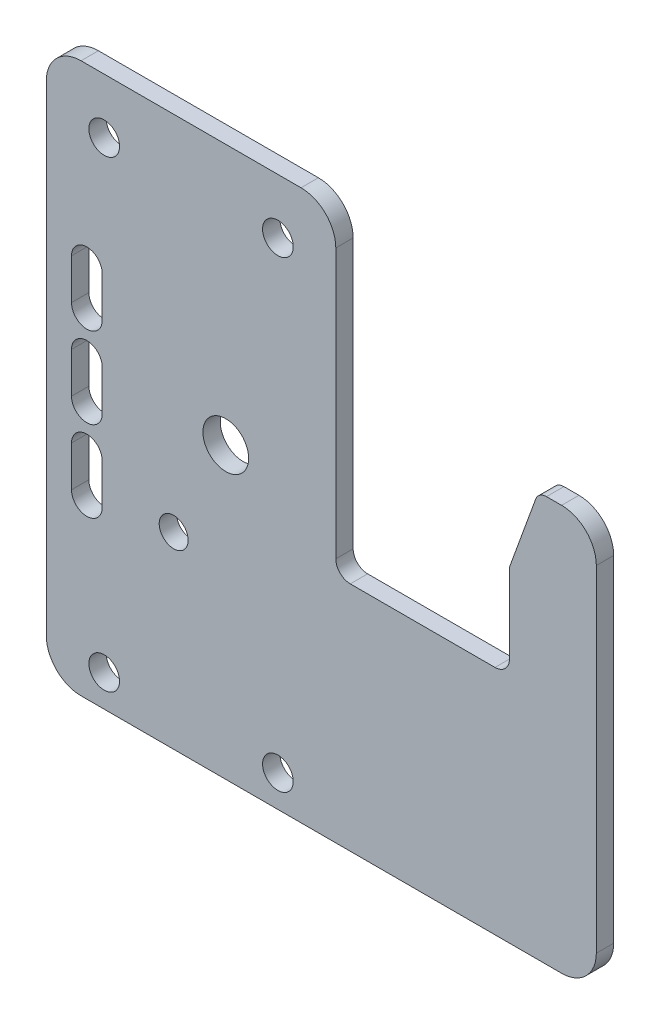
ISO-10303-21;
HEADER;
FILE_DESCRIPTION(('STEP AP214'),'2;1');
FILE_NAME('part.step','',(''),(''),'','','');
FILE_SCHEMA(('AUTOMOTIVE_DESIGN { 1 0 10303 214 1 1 1 1 }'));
ENDSEC;
DATA;
#1=APPLICATION_CONTEXT('core data for automotive mechanical design processes');
#2=APPLICATION_PROTOCOL_DEFINITION('international standard','automotive_design',2000,#1);
#3=PRODUCT_CONTEXT('',#1,'mechanical');
#4=PRODUCT('Part','Part','',(#3));
#5=PRODUCT_RELATED_PRODUCT_CATEGORY('part','',(#4));
#6=PRODUCT_DEFINITION_FORMATION('','',#4);
#7=PRODUCT_DEFINITION_CONTEXT('part definition',#1,'design');
#8=PRODUCT_DEFINITION('design','',#6,#7);
#9=PRODUCT_DEFINITION_SHAPE('','',#8);
#10=(LENGTH_UNIT() NAMED_UNIT(*) SI_UNIT(.MILLI.,.METRE.));
#11=(NAMED_UNIT(*) PLANE_ANGLE_UNIT() SI_UNIT($,.RADIAN.));
#12=(NAMED_UNIT(*) SI_UNIT($,.STERADIAN.) SOLID_ANGLE_UNIT());
#13=UNCERTAINTY_MEASURE_WITH_UNIT(LENGTH_MEASURE(1.E-05),#10,'distance_accuracy_value','');
#14=(GEOMETRIC_REPRESENTATION_CONTEXT(3) GLOBAL_UNCERTAINTY_ASSIGNED_CONTEXT((#13)) GLOBAL_UNIT_ASSIGNED_CONTEXT((#10,
#11,#12)) REPRESENTATION_CONTEXT('',''));
#15=CARTESIAN_POINT('',(0.,0.,0.));
#16=DIRECTION('',(0.,0.,1.));
#17=DIRECTION('',(1.,0.,0.));
#18=AXIS2_PLACEMENT_3D('',#15,#16,#17);
#19=CARTESIAN_POINT('',(80.,40.,3.));
#20=DIRECTION('',(1.,0.,0.));
#21=DIRECTION('',(0.,-1.,0.));
#22=AXIS2_PLACEMENT_3D('',#19,#20,#21);
#23=PLANE('',#22);
#24=DIRECTION('',(0.,0.,1.));
#25=VECTOR('',#24,1.);
#26=CARTESIAN_POINT('',(80.,55.9099589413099,3.));
#27=LINE('',#26,#25);
#28=CARTESIAN_POINT('',(80.,55.9099589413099,0.));
#29=VERTEX_POINT('',#28);
#30=CARTESIAN_POINT('',(80.,55.9099589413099,3.));
#31=VERTEX_POINT('',#30);
#32=EDGE_CURVE('E11',#29,#31,#27,.T.);
#33=ORIENTED_EDGE('',*,*,#32,.F.);
#34=DIRECTION('',(0.,1.,0.));
#35=VECTOR('',#34,1.);
#36=CARTESIAN_POINT('',(80.,0.,0.));
#37=LINE('',#36,#35);
#38=CARTESIAN_POINT('',(80.,42.5,0.));
#39=VERTEX_POINT('',#38);
#40=EDGE_CURVE('E170',#29,#39,#37,.F.);
#41=ORIENTED_EDGE('',*,*,#40,.T.);
#42=DIRECTION('',(0.,0.,1.));
#43=VECTOR('',#42,1.);
#44=CARTESIAN_POINT('',(80.,42.5,3.));
#45=LINE('',#44,#43);
#46=CARTESIAN_POINT('',(80.,42.5,3.));
#47=VERTEX_POINT('',#46);
#48=EDGE_CURVE('E44',#39,#47,#45,.T.);
#49=ORIENTED_EDGE('',*,*,#48,.T.);
#50=DIRECTION('',(0.,-1.,0.));
#51=VECTOR('',#50,1.);
#52=CARTESIAN_POINT('',(80.,40.,3.));
#53=LINE('',#52,#51);
#54=EDGE_CURVE('E311',#31,#47,#53,.T.);
#55=ORIENTED_EDGE('',*,*,#54,.F.);
#56=EDGE_LOOP('',(#33,#41,#49,#55));
#57=FACE_BOUND('',#56,.T.);
#58=ADVANCED_FACE('F34',(#57),#23,.F.);
#59=CARTESIAN_POINT('',(77.5,42.5,3.));
#60=DIRECTION('',(0.,0.,-1.));
#61=DIRECTION('',(-1.,0.,0.));
#62=AXIS2_PLACEMENT_3D('',#59,#60,#61);
#63=CYLINDRICAL_SURFACE('',#62,2.5);
#64=ORIENTED_EDGE('',*,*,#48,.F.);
#65=CARTESIAN_POINT('',(77.5,42.5,0.));
#66=DIRECTION('',(0.,0.,-1.));
#67=DIRECTION('',(-1.,0.,0.));
#68=AXIS2_PLACEMENT_3D('',#65,#66,#67);
#69=CIRCLE('',#68,2.5);
#70=CARTESIAN_POINT('',(77.5,40.,0.));
#71=VERTEX_POINT('',#70);
#72=EDGE_CURVE('E222',#39,#71,#69,.T.);
#73=ORIENTED_EDGE('',*,*,#72,.T.);
#74=DIRECTION('',(0.,0.,1.));
#75=VECTOR('',#74,1.);
#76=CARTESIAN_POINT('',(77.5,40.,3.));
#77=LINE('',#76,#75);
#78=CARTESIAN_POINT('',(77.5,40.,3.));
#79=VERTEX_POINT('',#78);
#80=EDGE_CURVE('E304',#71,#79,#77,.T.);
#81=ORIENTED_EDGE('',*,*,#80,.T.);
#82=CARTESIAN_POINT('',(77.5,42.5,3.));
#83=DIRECTION('',(0.,0.,-1.));
#84=DIRECTION('',(-1.,0.,0.));
#85=AXIS2_PLACEMENT_3D('',#82,#83,#84);
#86=CIRCLE('',#85,2.5);
#87=EDGE_CURVE('E321',#47,#79,#86,.T.);
#88=ORIENTED_EDGE('',*,*,#87,.F.);
#89=EDGE_LOOP('',(#64,#73,#81,#88));
#90=FACE_BOUND('',#89,.T.);
#91=ADVANCED_FACE('F324',(#90),#63,.F.);
#92=CARTESIAN_POINT('',(50.,40.,3.));
#93=DIRECTION('',(0.,-1.,0.));
#94=DIRECTION('',(-1.,0.,0.));
#95=AXIS2_PLACEMENT_3D('',#92,#93,#94);
#96=PLANE('',#95);
#97=ORIENTED_EDGE('',*,*,#80,.F.);
#98=DIRECTION('',(-1.,0.,0.));
#99=VECTOR('',#98,1.);
#100=CARTESIAN_POINT('',(0.,40.,0.));
#101=LINE('',#100,#99);
#102=CARTESIAN_POINT('',(52.5,40.,0.));
#103=VERTEX_POINT('',#102);
#104=EDGE_CURVE('E219',#71,#103,#101,.T.);
#105=ORIENTED_EDGE('',*,*,#104,.T.);
#106=DIRECTION('',(0.,0.,1.));
#107=VECTOR('',#106,1.);
#108=CARTESIAN_POINT('',(52.5,40.,3.));
#109=LINE('',#108,#107);
#110=CARTESIAN_POINT('',(52.5,40.,3.));
#111=VERTEX_POINT('',#110);
#112=EDGE_CURVE('E301',#103,#111,#109,.T.);
#113=ORIENTED_EDGE('',*,*,#112,.T.);
#114=DIRECTION('',(-1.,0.,0.));
#115=VECTOR('',#114,1.);
#116=CARTESIAN_POINT('',(50.,40.,3.));
#117=LINE('',#116,#115);
#118=EDGE_CURVE('E325',#79,#111,#117,.T.);
#119=ORIENTED_EDGE('',*,*,#118,.F.);
#120=EDGE_LOOP('',(#97,#105,#113,#119));
#121=FACE_BOUND('',#120,.T.);
#122=ADVANCED_FACE('F441',(#121),#96,.F.);
#123=CARTESIAN_POINT('',(52.5,42.5,3.));
#124=DIRECTION('',(0.,0.,-1.));
#125=DIRECTION('',(-1.,0.,0.));
#126=AXIS2_PLACEMENT_3D('',#123,#124,#125);
#127=CYLINDRICAL_SURFACE('',#126,2.5);
#128=ORIENTED_EDGE('',*,*,#112,.F.);
#129=CARTESIAN_POINT('',(52.5,42.5,0.));
#130=DIRECTION('',(0.,0.,-1.));
#131=DIRECTION('',(-1.,0.,0.));
#132=AXIS2_PLACEMENT_3D('',#129,#130,#131);
#133=CIRCLE('',#132,2.5);
#134=CARTESIAN_POINT('',(50.,42.5,0.));
#135=VERTEX_POINT('',#134);
#136=EDGE_CURVE('E216',#103,#135,#133,.T.);
#137=ORIENTED_EDGE('',*,*,#136,.T.);
#138=DIRECTION('',(0.,0.,1.));
#139=VECTOR('',#138,1.);
#140=CARTESIAN_POINT('',(50.,42.5,3.));
#141=LINE('',#140,#139);
#142=CARTESIAN_POINT('',(50.,42.5,3.));
#143=VERTEX_POINT('',#142);
#144=EDGE_CURVE('E298',#135,#143,#141,.T.);
#145=ORIENTED_EDGE('',*,*,#144,.T.);
#146=CARTESIAN_POINT('',(52.5,42.5,3.));
#147=DIRECTION('',(0.,0.,-1.));
#148=DIRECTION('',(-1.,0.,0.));
#149=AXIS2_PLACEMENT_3D('',#146,#147,#148);
#150=CIRCLE('',#149,2.5);
#151=EDGE_CURVE('E327',#111,#143,#150,.T.);
#152=ORIENTED_EDGE('',*,*,#151,.F.);
#153=EDGE_LOOP('',(#128,#137,#145,#152));
#154=FACE_BOUND('',#153,.T.);
#155=ADVANCED_FACE('F623',(#154),#127,.F.);
#156=CARTESIAN_POINT('',(50.,95.,3.));
#157=DIRECTION('',(-1.,0.,0.));
#158=DIRECTION('',(0.,1.,0.));
#159=AXIS2_PLACEMENT_3D('',#156,#157,#158);
#160=PLANE('',#159);
#161=ORIENTED_EDGE('',*,*,#144,.F.);
#162=DIRECTION('',(0.,1.,0.));
#163=VECTOR('',#162,1.);
#164=CARTESIAN_POINT('',(50.,0.,0.));
#165=LINE('',#164,#163);
#166=CARTESIAN_POINT('',(50.,89.,0.));
#167=VERTEX_POINT('',#166);
#168=EDGE_CURVE('E213',#135,#167,#165,.T.);
#169=ORIENTED_EDGE('',*,*,#168,.T.);
#170=DIRECTION('',(0.,0.,1.));
#171=VECTOR('',#170,1.);
#172=CARTESIAN_POINT('',(50.,89.,3.));
#173=LINE('',#172,#171);
#174=CARTESIAN_POINT('',(50.,89.,3.));
#175=VERTEX_POINT('',#174);
#176=EDGE_CURVE('E295',#167,#175,#173,.T.);
#177=ORIENTED_EDGE('',*,*,#176,.T.);
#178=DIRECTION('',(0.,1.,0.));
#179=VECTOR('',#178,1.);
#180=CARTESIAN_POINT('',(50.,95.,3.));
#181=LINE('',#180,#179);
#182=EDGE_CURVE('E333',#143,#175,#181,.T.);
#183=ORIENTED_EDGE('',*,*,#182,.F.);
#184=EDGE_LOOP('',(#161,#169,#177,#183));
#185=FACE_BOUND('',#184,.T.);
#186=ADVANCED_FACE('F618',(#185),#160,.F.);
#187=CARTESIAN_POINT('',(44.,89.,3.));
#188=DIRECTION('',(0.,0.,-1.));
#189=DIRECTION('',(-1.,0.,0.));
#190=AXIS2_PLACEMENT_3D('',#187,#188,#189);
#191=CYLINDRICAL_SURFACE('',#190,6.);
#192=ORIENTED_EDGE('',*,*,#176,.F.);
#193=CARTESIAN_POINT('',(44.,89.,0.));
#194=DIRECTION('',(0.,0.,-1.));
#195=DIRECTION('',(-1.,0.,0.));
#196=AXIS2_PLACEMENT_3D('',#193,#194,#195);
#197=CIRCLE('',#196,6.);
#198=CARTESIAN_POINT('',(44.,95.,0.));
#199=VERTEX_POINT('',#198);
#200=EDGE_CURVE('E210',#167,#199,#197,.F.);
#201=ORIENTED_EDGE('',*,*,#200,.T.);
#202=DIRECTION('',(0.,0.,1.));
#203=VECTOR('',#202,1.);
#204=CARTESIAN_POINT('',(44.,95.,3.));
#205=LINE('',#204,#203);
#206=CARTESIAN_POINT('',(44.,95.,3.));
#207=VERTEX_POINT('',#206);
#208=EDGE_CURVE('E292',#199,#207,#205,.T.);
#209=ORIENTED_EDGE('',*,*,#208,.T.);
#210=CARTESIAN_POINT('',(44.,89.,3.));
#211=DIRECTION('',(0.,0.,-1.));
#212=DIRECTION('',(-1.,0.,0.));
#213=AXIS2_PLACEMENT_3D('',#210,#211,#212);
#214=CIRCLE('',#213,6.);
#215=EDGE_CURVE('E336',#175,#207,#214,.F.);
#216=ORIENTED_EDGE('',*,*,#215,.F.);
#217=EDGE_LOOP('',(#192,#201,#209,#216));
#218=FACE_BOUND('',#217,.T.);
#219=ADVANCED_FACE('F614',(#218),#191,.T.);
#220=CARTESIAN_POINT('',(0.,95.,3.));
#221=DIRECTION('',(0.,-1.,0.));
#222=DIRECTION('',(-1.,0.,0.));
#223=AXIS2_PLACEMENT_3D('',#220,#221,#222);
#224=PLANE('',#223);
#225=ORIENTED_EDGE('',*,*,#208,.F.);
#226=DIRECTION('',(-1.,0.,0.));
#227=VECTOR('',#226,1.);
#228=CARTESIAN_POINT('',(0.,95.,0.));
#229=LINE('',#228,#227);
#230=CARTESIAN_POINT('',(6.,95.,0.));
#231=VERTEX_POINT('',#230);
#232=EDGE_CURVE('E207',#199,#231,#229,.T.);
#233=ORIENTED_EDGE('',*,*,#232,.T.);
#234=DIRECTION('',(0.,0.,1.));
#235=VECTOR('',#234,1.);
#236=CARTESIAN_POINT('',(6.,95.,3.));
#237=LINE('',#236,#235);
#238=CARTESIAN_POINT('',(6.,95.,3.));
#239=VERTEX_POINT('',#238);
#240=EDGE_CURVE('E289',#231,#239,#237,.T.);
#241=ORIENTED_EDGE('',*,*,#240,.T.);
#242=DIRECTION('',(-1.,0.,0.));
#243=VECTOR('',#242,1.);
#244=CARTESIAN_POINT('',(0.,95.,3.));
#245=LINE('',#244,#243);
#246=EDGE_CURVE('E339',#207,#239,#245,.T.);
#247=ORIENTED_EDGE('',*,*,#246,.F.);
#248=EDGE_LOOP('',(#225,#233,#241,#247));
#249=FACE_BOUND('',#248,.T.);
#250=ADVANCED_FACE('F611',(#249),#224,.F.);
#251=CARTESIAN_POINT('',(6.,89.,3.));
#252=DIRECTION('',(0.,0.,-1.));
#253=DIRECTION('',(-1.,0.,0.));
#254=AXIS2_PLACEMENT_3D('',#251,#252,#253);
#255=CYLINDRICAL_SURFACE('',#254,6.);
#256=ORIENTED_EDGE('',*,*,#240,.F.);
#257=CARTESIAN_POINT('',(6.,89.,0.));
#258=DIRECTION('',(0.,0.,-1.));
#259=DIRECTION('',(-1.,0.,0.));
#260=AXIS2_PLACEMENT_3D('',#257,#258,#259);
#261=CIRCLE('',#260,6.);
#262=CARTESIAN_POINT('',(0.,89.,0.));
#263=VERTEX_POINT('',#262);
#264=EDGE_CURVE('E204',#231,#263,#261,.F.);
#265=ORIENTED_EDGE('',*,*,#264,.T.);
#266=DIRECTION('',(0.,0.,1.));
#267=VECTOR('',#266,1.);
#268=CARTESIAN_POINT('',(0.,89.,3.));
#269=LINE('',#268,#267);
#270=CARTESIAN_POINT('',(0.,89.,3.));
#271=VERTEX_POINT('',#270);
#272=EDGE_CURVE('E286',#263,#271,#269,.T.);
#273=ORIENTED_EDGE('',*,*,#272,.T.);
#274=CARTESIAN_POINT('',(6.,89.,3.));
#275=DIRECTION('',(0.,0.,-1.));
#276=DIRECTION('',(-1.,0.,0.));
#277=AXIS2_PLACEMENT_3D('',#274,#275,#276);
#278=CIRCLE('',#277,6.);
#279=EDGE_CURVE('E342',#239,#271,#278,.F.);
#280=ORIENTED_EDGE('',*,*,#279,.F.);
#281=EDGE_LOOP('',(#256,#265,#273,#280));
#282=FACE_BOUND('',#281,.T.);
#283=ADVANCED_FACE('F606',(#282),#255,.T.);
#284=CARTESIAN_POINT('',(0.,0.,3.));
#285=DIRECTION('',(1.,0.,0.));
#286=DIRECTION('',(0.,-1.,0.));
#287=AXIS2_PLACEMENT_3D('',#284,#285,#286);
#288=PLANE('',#287);
#289=ORIENTED_EDGE('',*,*,#272,.F.);
#290=DIRECTION('',(0.,1.,0.));
#291=VECTOR('',#290,1.);
#292=CARTESIAN_POINT('',(0.,0.,0.));
#293=LINE('',#292,#291);
#294=CARTESIAN_POINT('',(0.,6.,0.));
#295=VERTEX_POINT('',#294);
#296=EDGE_CURVE('E201',#263,#295,#293,.F.);
#297=ORIENTED_EDGE('',*,*,#296,.T.);
#298=DIRECTION('',(0.,0.,1.));
#299=VECTOR('',#298,1.);
#300=CARTESIAN_POINT('',(0.,6.,3.));
#301=LINE('',#300,#299);
#302=CARTESIAN_POINT('',(0.,6.,3.));
#303=VERTEX_POINT('',#302);
#304=EDGE_CURVE('E283',#295,#303,#301,.T.);
#305=ORIENTED_EDGE('',*,*,#304,.T.);
#306=DIRECTION('',(0.,-1.,0.));
#307=VECTOR('',#306,1.);
#308=CARTESIAN_POINT('',(0.,0.,3.));
#309=LINE('',#308,#307);
#310=EDGE_CURVE('E345',#271,#303,#309,.T.);
#311=ORIENTED_EDGE('',*,*,#310,.F.);
#312=EDGE_LOOP('',(#289,#297,#305,#311));
#313=FACE_BOUND('',#312,.T.);
#314=ADVANCED_FACE('F602',(#313),#288,.F.);
#315=CARTESIAN_POINT('',(6.00000000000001,6.,3.));
#316=DIRECTION('',(0.,0.,-1.));
#317=DIRECTION('',(-1.,0.,0.));
#318=AXIS2_PLACEMENT_3D('',#315,#316,#317);
#319=CYLINDRICAL_SURFACE('',#318,6.);
#320=ORIENTED_EDGE('',*,*,#304,.F.);
#321=CARTESIAN_POINT('',(6.00000000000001,6.,0.));
#322=DIRECTION('',(0.,0.,-1.));
#323=DIRECTION('',(-1.,0.,0.));
#324=AXIS2_PLACEMENT_3D('',#321,#322,#323);
#325=CIRCLE('',#324,6.);
#326=CARTESIAN_POINT('',(6.00000000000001,0.,0.));
#327=VERTEX_POINT('',#326);
#328=EDGE_CURVE('E198',#295,#327,#325,.F.);
#329=ORIENTED_EDGE('',*,*,#328,.T.);
#330=DIRECTION('',(0.,0.,1.));
#331=VECTOR('',#330,1.);
#332=CARTESIAN_POINT('',(6.00000000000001,0.,3.));
#333=LINE('',#332,#331);
#334=CARTESIAN_POINT('',(6.00000000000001,0.,3.));
#335=VERTEX_POINT('',#334);
#336=EDGE_CURVE('E280',#327,#335,#333,.T.);
#337=ORIENTED_EDGE('',*,*,#336,.T.);
#338=CARTESIAN_POINT('',(6.00000000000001,6.,3.));
#339=DIRECTION('',(0.,0.,-1.));
#340=DIRECTION('',(-1.,0.,0.));
#341=AXIS2_PLACEMENT_3D('',#338,#339,#340);
#342=CIRCLE('',#341,6.);
#343=EDGE_CURVE('E348',#303,#335,#342,.F.);
#344=ORIENTED_EDGE('',*,*,#343,.F.);
#345=EDGE_LOOP('',(#320,#329,#337,#344));
#346=FACE_BOUND('',#345,.T.);
#347=ADVANCED_FACE('F599',(#346),#319,.T.);
#348=CARTESIAN_POINT('',(95.,0.,3.));
#349=DIRECTION('',(0.,1.,0.));
#350=DIRECTION('',(1.,0.,0.));
#351=AXIS2_PLACEMENT_3D('',#348,#349,#350);
#352=PLANE('',#351);
#353=ORIENTED_EDGE('',*,*,#336,.F.);
#354=DIRECTION('',(-1.,0.,0.));
#355=VECTOR('',#354,1.);
#356=CARTESIAN_POINT('',(0.,0.,0.));
#357=LINE('',#356,#355);
#358=CARTESIAN_POINT('',(89.,0.,0.));
#359=VERTEX_POINT('',#358);
#360=EDGE_CURVE('E195',#327,#359,#357,.F.);
#361=ORIENTED_EDGE('',*,*,#360,.T.);
#362=DIRECTION('',(0.,0.,1.));
#363=VECTOR('',#362,1.);
#364=CARTESIAN_POINT('',(89.,0.,3.));
#365=LINE('',#364,#363);
#366=CARTESIAN_POINT('',(89.,0.,3.));
#367=VERTEX_POINT('',#366);
#368=EDGE_CURVE('E277',#359,#367,#365,.T.);
#369=ORIENTED_EDGE('',*,*,#368,.T.);
#370=DIRECTION('',(1.,0.,0.));
#371=VECTOR('',#370,1.);
#372=CARTESIAN_POINT('',(95.,0.,3.));
#373=LINE('',#372,#371);
#374=EDGE_CURVE('E351',#335,#367,#373,.T.);
#375=ORIENTED_EDGE('',*,*,#374,.F.);
#376=EDGE_LOOP('',(#353,#361,#369,#375));
#377=FACE_BOUND('',#376,.T.);
#378=ADVANCED_FACE('F594',(#377),#352,.F.);
#379=CARTESIAN_POINT('',(89.,6.00000000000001,3.));
#380=DIRECTION('',(0.,0.,-1.));
#381=DIRECTION('',(-1.,0.,0.));
#382=AXIS2_PLACEMENT_3D('',#379,#380,#381);
#383=CYLINDRICAL_SURFACE('',#382,6.);
#384=ORIENTED_EDGE('',*,*,#368,.F.);
#385=CARTESIAN_POINT('',(89.,6.00000000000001,0.));
#386=DIRECTION('',(0.,0.,-1.));
#387=DIRECTION('',(-1.,0.,0.));
#388=AXIS2_PLACEMENT_3D('',#385,#386,#387);
#389=CIRCLE('',#388,6.);
#390=CARTESIAN_POINT('',(95.,6.00000000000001,0.));
#391=VERTEX_POINT('',#390);
#392=EDGE_CURVE('E192',#359,#391,#389,.F.);
#393=ORIENTED_EDGE('',*,*,#392,.T.);
#394=DIRECTION('',(0.,0.,1.));
#395=VECTOR('',#394,1.);
#396=CARTESIAN_POINT('',(95.,6.00000000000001,3.));
#397=LINE('',#396,#395);
#398=CARTESIAN_POINT('',(95.,6.00000000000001,3.));
#399=VERTEX_POINT('',#398);
#400=EDGE_CURVE('E274',#391,#399,#397,.T.);
#401=ORIENTED_EDGE('',*,*,#400,.T.);
#402=CARTESIAN_POINT('',(89.,6.00000000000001,3.));
#403=DIRECTION('',(0.,0.,-1.));
#404=DIRECTION('',(-1.,0.,0.));
#405=AXIS2_PLACEMENT_3D('',#402,#403,#404);
#406=CIRCLE('',#405,6.);
#407=EDGE_CURVE('E354',#367,#399,#406,.F.);
#408=ORIENTED_EDGE('',*,*,#407,.F.);
#409=EDGE_LOOP('',(#384,#393,#401,#408));
#410=FACE_BOUND('',#409,.T.);
#411=ADVANCED_FACE('F590',(#410),#383,.T.);
#412=CARTESIAN_POINT('',(95.,70.,3.));
#413=DIRECTION('',(-1.,0.,0.));
#414=DIRECTION('',(0.,1.,0.));
#415=AXIS2_PLACEMENT_3D('',#412,#413,#414);
#416=PLANE('',#415);
#417=ORIENTED_EDGE('',*,*,#400,.F.);
#418=DIRECTION('',(0.,1.,0.));
#419=VECTOR('',#418,1.);
#420=CARTESIAN_POINT('',(95.,0.,0.));
#421=LINE('',#420,#419);
#422=CARTESIAN_POINT('',(95.,64.,0.));
#423=VERTEX_POINT('',#422);
#424=EDGE_CURVE('E189',#391,#423,#421,.T.);
#425=ORIENTED_EDGE('',*,*,#424,.T.);
#426=DIRECTION('',(0.,0.,1.));
#427=VECTOR('',#426,1.);
#428=CARTESIAN_POINT('',(95.,64.,3.));
#429=LINE('',#428,#427);
#430=CARTESIAN_POINT('',(95.,64.,3.));
#431=VERTEX_POINT('',#430);
#432=EDGE_CURVE('E271',#423,#431,#429,.T.);
#433=ORIENTED_EDGE('',*,*,#432,.T.);
#434=DIRECTION('',(0.,1.,0.));
#435=VECTOR('',#434,1.);
#436=CARTESIAN_POINT('',(95.,70.,3.));
#437=LINE('',#436,#435);
#438=EDGE_CURVE('E357',#399,#431,#437,.T.);
#439=ORIENTED_EDGE('',*,*,#438,.F.);
#440=EDGE_LOOP('',(#417,#425,#433,#439));
#441=FACE_BOUND('',#440,.T.);
#442=ADVANCED_FACE('F587',(#441),#416,.F.);
#443=CARTESIAN_POINT('',(89.,64.,3.));
#444=DIRECTION('',(0.,0.,-1.));
#445=DIRECTION('',(-1.,0.,0.));
#446=AXIS2_PLACEMENT_3D('',#443,#444,#445);
#447=CYLINDRICAL_SURFACE('',#446,6.);
#448=ORIENTED_EDGE('',*,*,#432,.F.);
#449=CARTESIAN_POINT('',(89.,64.,0.));
#450=DIRECTION('',(0.,0.,-1.));
#451=DIRECTION('',(-1.,0.,0.));
#452=AXIS2_PLACEMENT_3D('',#449,#450,#451);
#453=CIRCLE('',#452,6.);
#454=CARTESIAN_POINT('',(89.,70.,0.));
#455=VERTEX_POINT('',#454);
#456=EDGE_CURVE('E186',#423,#455,#453,.F.);
#457=ORIENTED_EDGE('',*,*,#456,.T.);
#458=DIRECTION('',(0.,0.,1.));
#459=VECTOR('',#458,1.);
#460=CARTESIAN_POINT('',(89.,70.,3.));
#461=LINE('',#460,#459);
#462=CARTESIAN_POINT('',(89.,70.,3.));
#463=VERTEX_POINT('',#462);
#464=EDGE_CURVE('E268',#455,#463,#461,.T.);
#465=ORIENTED_EDGE('',*,*,#464,.T.);
#466=CARTESIAN_POINT('',(89.,64.,3.));
#467=DIRECTION('',(0.,0.,-1.));
#468=DIRECTION('',(-1.,0.,0.));
#469=AXIS2_PLACEMENT_3D('',#466,#467,#468);
#470=CIRCLE('',#469,6.);
#471=EDGE_CURVE('E360',#431,#463,#470,.F.);
#472=ORIENTED_EDGE('',*,*,#471,.F.);
#473=EDGE_LOOP('',(#448,#457,#465,#472));
#474=FACE_BOUND('',#473,.T.);
#475=ADVANCED_FACE('F576',(#474),#447,.T.);
#476=CARTESIAN_POINT('',(80.,70.,3.));
#477=DIRECTION('',(0.,-1.,0.));
#478=DIRECTION('',(-1.,0.,0.));
#479=AXIS2_PLACEMENT_3D('',#476,#477,#478);
#480=PLANE('',#479);
#481=ORIENTED_EDGE('',*,*,#464,.F.);
#482=DIRECTION('',(-1.,0.,0.));
#483=VECTOR('',#482,1.);
#484=CARTESIAN_POINT('',(0.,70.,0.));
#485=LINE('',#484,#483);
#486=CARTESIAN_POINT('',(86.4004150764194,70.,0.));
#487=VERTEX_POINT('',#486);
#488=EDGE_CURVE('E183',#455,#487,#485,.T.);
#489=ORIENTED_EDGE('',*,*,#488,.T.);
#490=DIRECTION('',(0.,0.,1.));
#491=VECTOR('',#490,1.);
#492=CARTESIAN_POINT('',(86.4004150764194,70.,3.));
#493=LINE('',#492,#491);
#494=CARTESIAN_POINT('',(86.4004150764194,70.,3.));
#495=VERTEX_POINT('',#494);
#496=EDGE_CURVE('E266',#487,#495,#493,.T.);
#497=ORIENTED_EDGE('',*,*,#496,.T.);
#498=DIRECTION('',(-1.,0.,0.));
#499=VECTOR('',#498,1.);
#500=CARTESIAN_POINT('',(80.,70.,3.));
#501=LINE('',#500,#499);
#502=EDGE_CURVE('E363',#463,#495,#501,.T.);
#503=ORIENTED_EDGE('',*,*,#502,.F.);
#504=EDGE_LOOP('',(#481,#489,#497,#503));
#505=FACE_BOUND('',#504,.T.);
#506=ADVANCED_FACE('F582',(#505),#480,.F.);
#507=CARTESIAN_POINT('',(86.4004150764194,68.,3.));
#508=DIRECTION('',(0.,0.,-1.));
#509=DIRECTION('',(-1.,0.,0.));
#510=AXIS2_PLACEMENT_3D('',#507,#508,#509);
#511=CYLINDRICAL_SURFACE('',#510,2.);
#512=ORIENTED_EDGE('',*,*,#496,.F.);
#513=CARTESIAN_POINT('',(86.4004150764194,68.,0.));
#514=DIRECTION('',(0.,0.,-1.));
#515=DIRECTION('',(-1.,0.,0.));
#516=AXIS2_PLACEMENT_3D('',#513,#514,#515);
#517=CIRCLE('',#516,2.);
#518=CARTESIAN_POINT('',(84.5210298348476,68.6840402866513,0.));
#519=VERTEX_POINT('',#518);
#520=EDGE_CURVE('E180',#487,#519,#517,.F.);
#521=ORIENTED_EDGE('',*,*,#520,.T.);
#522=DIRECTION('',(0.,0.,1.));
#523=VECTOR('',#522,1.);
#524=CARTESIAN_POINT('',(84.5210298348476,68.6840402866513,3.));
#525=LINE('',#524,#523);
#526=CARTESIAN_POINT('',(84.5210298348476,68.6840402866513,3.));
#527=VERTEX_POINT('',#526);
#528=EDGE_CURVE('E52',#519,#527,#525,.T.);
#529=ORIENTED_EDGE('',*,*,#528,.T.);
#530=CARTESIAN_POINT('',(86.4004150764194,68.,3.));
#531=DIRECTION('',(0.,0.,-1.));
#532=DIRECTION('',(-1.,0.,0.));
#533=AXIS2_PLACEMENT_3D('',#530,#531,#532);
#534=CIRCLE('',#533,2.);
#535=EDGE_CURVE('E366',#495,#527,#534,.F.);
#536=ORIENTED_EDGE('',*,*,#535,.F.);
#537=EDGE_LOOP('',(#512,#521,#529,#536));
#538=FACE_BOUND('',#537,.T.);
#539=ADVANCED_FACE('F583',(#538),#511,.T.);
#540=CARTESIAN_POINT('',(80.,56.2626129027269,3.));
#541=DIRECTION('',(-0.939692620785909,0.342020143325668,0.));
#542=DIRECTION('',(0.342020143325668,0.939692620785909,0.));
#543=AXIS2_PLACEMENT_3D('',#540,#541,#542);
#544=PLANE('',#543);
#545=ORIENTED_EDGE('',*,*,#528,.F.);
#546=DIRECTION('',(0.342020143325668,0.939692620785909,0.));
#547=VECTOR('',#546,1.);
#548=CARTESIAN_POINT('',(80.,56.2626129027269,0.));
#549=LINE('',#548,#547);
#550=CARTESIAN_POINT('',(80.1206147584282,56.5939992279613,0.));
#551=VERTEX_POINT('',#550);
#552=EDGE_CURVE('E168',#519,#551,#549,.F.);
#553=ORIENTED_EDGE('',*,*,#552,.T.);
#554=DIRECTION('',(0.,0.,1.));
#555=VECTOR('',#554,1.);
#556=CARTESIAN_POINT('',(80.1206147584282,56.5939992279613,3.));
#557=LINE('',#556,#555);
#558=CARTESIAN_POINT('',(80.1206147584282,56.5939992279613,3.));
#559=VERTEX_POINT('',#558);
#560=EDGE_CURVE('E38',#551,#559,#557,.T.);
#561=ORIENTED_EDGE('',*,*,#560,.T.);
#562=DIRECTION('',(0.342020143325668,0.939692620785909,0.));
#563=VECTOR('',#562,1.);
#564=CARTESIAN_POINT('',(80.,56.2626129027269,3.));
#565=LINE('',#564,#563);
#566=EDGE_CURVE('E544',#527,#559,#565,.F.);
#567=ORIENTED_EDGE('',*,*,#566,.F.);
#568=EDGE_LOOP('',(#545,#553,#561,#567));
#569=FACE_BOUND('',#568,.T.);
#570=ADVANCED_FACE('F172',(#569),#544,.T.);
#571=CARTESIAN_POINT('',(9.65,65.,3.));
#572=DIRECTION('',(-1.,0.,0.));
#573=DIRECTION('',(0.,1.,0.));
#574=AXIS2_PLACEMENT_3D('',#571,#572,#573);
#575=PLANE('',#574);
#576=DIRECTION('',(0.,0.,1.));
#577=VECTOR('',#576,1.);
#578=CARTESIAN_POINT('',(9.65,65.,3.));
#579=LINE('',#578,#577);
#580=CARTESIAN_POINT('',(9.65,65.,0.));
#581=VERTEX_POINT('',#580);
#582=CARTESIAN_POINT('',(9.65,65.,3.));
#583=VERTEX_POINT('',#582);
#584=EDGE_CURVE('E162',#581,#583,#579,.T.);
#585=ORIENTED_EDGE('',*,*,#584,.F.);
#586=DIRECTION('',(0.,1.,0.));
#587=VECTOR('',#586,1.);
#588=CARTESIAN_POINT('',(9.65,0.,0.));
#589=LINE('',#588,#587);
#590=CARTESIAN_POINT('',(9.65,58.,0.));
#591=VERTEX_POINT('',#590);
#592=EDGE_CURVE('E403',#591,#581,#589,.T.);
#593=ORIENTED_EDGE('',*,*,#592,.F.);
#594=DIRECTION('',(0.,0.,1.));
#595=VECTOR('',#594,1.);
#596=CARTESIAN_POINT('',(9.65,58.,3.));
#597=LINE('',#596,#595);
#598=CARTESIAN_POINT('',(9.65,58.,3.));
#599=VERTEX_POINT('',#598);
#600=EDGE_CURVE('E258',#591,#599,#597,.T.);
#601=ORIENTED_EDGE('',*,*,#600,.T.);
#602=DIRECTION('',(0.,1.,0.));
#603=VECTOR('',#602,1.);
#604=CARTESIAN_POINT('',(9.65,65.,3.));
#605=LINE('',#604,#603);
#606=EDGE_CURVE('E979',#599,#583,#605,.T.);
#607=ORIENTED_EDGE('',*,*,#606,.T.);
#608=EDGE_LOOP('',(#585,#593,#601,#607));
#609=FACE_BOUND('',#608,.T.);
#610=ADVANCED_FACE('F503',(#609),#575,.T.);
#611=CARTESIAN_POINT('',(7.,58.,3.));
#612=DIRECTION('',(0.,0.,1.));
#613=DIRECTION('',(1.,0.,0.));
#614=AXIS2_PLACEMENT_3D('',#611,#612,#613);
#615=CYLINDRICAL_SURFACE('',#614,2.65);
#616=ORIENTED_EDGE('',*,*,#600,.F.);
#617=CARTESIAN_POINT('',(7.,58.,0.));
#618=DIRECTION('',(0.,0.,1.));
#619=DIRECTION('',(1.,0.,0.));
#620=AXIS2_PLACEMENT_3D('',#617,#618,#619);
#621=CIRCLE('',#620,2.65);
#622=CARTESIAN_POINT('',(4.35,58.,0.));
#623=VERTEX_POINT('',#622);
#624=EDGE_CURVE('E399',#623,#591,#621,.T.);
#625=ORIENTED_EDGE('',*,*,#624,.F.);
#626=DIRECTION('',(0.,0.,1.));
#627=VECTOR('',#626,1.);
#628=CARTESIAN_POINT('',(4.35,58.,3.));
#629=LINE('',#628,#627);
#630=CARTESIAN_POINT('',(4.35,58.,3.));
#631=VERTEX_POINT('',#630);
#632=EDGE_CURVE('E255',#623,#631,#629,.T.);
#633=ORIENTED_EDGE('',*,*,#632,.T.);
#634=CARTESIAN_POINT('',(7.,58.,3.));
#635=DIRECTION('',(0.,0.,1.));
#636=DIRECTION('',(1.,0.,0.));
#637=AXIS2_PLACEMENT_3D('',#634,#635,#636);
#638=CIRCLE('',#637,2.65);
#639=EDGE_CURVE('E536',#631,#599,#638,.T.);
#640=ORIENTED_EDGE('',*,*,#639,.T.);
#641=EDGE_LOOP('',(#616,#625,#633,#640));
#642=FACE_BOUND('',#641,.T.);
#643=ADVANCED_FACE('F499',(#642),#615,.F.);
#644=CARTESIAN_POINT('',(4.35,65.,3.));
#645=DIRECTION('',(1.,0.,0.));
#646=DIRECTION('',(0.,-1.,0.));
#647=AXIS2_PLACEMENT_3D('',#644,#645,#646);
#648=PLANE('',#647);
#649=ORIENTED_EDGE('',*,*,#632,.F.);
#650=DIRECTION('',(0.,1.,0.));
#651=VECTOR('',#650,1.);
#652=CARTESIAN_POINT('',(4.35,0.,0.));
#653=LINE('',#652,#651);
#654=CARTESIAN_POINT('',(4.35,65.,0.));
#655=VERTEX_POINT('',#654);
#656=EDGE_CURVE('E390',#655,#623,#653,.F.);
#657=ORIENTED_EDGE('',*,*,#656,.F.);
#658=DIRECTION('',(0.,0.,1.));
#659=VECTOR('',#658,1.);
#660=CARTESIAN_POINT('',(4.35,65.,3.));
#661=LINE('',#660,#659);
#662=CARTESIAN_POINT('',(4.35,65.,3.));
#663=VERTEX_POINT('',#662);
#664=EDGE_CURVE('E252',#655,#663,#661,.T.);
#665=ORIENTED_EDGE('',*,*,#664,.T.);
#666=DIRECTION('',(0.,-1.,0.));
#667=VECTOR('',#666,1.);
#668=CARTESIAN_POINT('',(4.35,65.,3.));
#669=LINE('',#668,#667);
#670=EDGE_CURVE('E993',#663,#631,#669,.T.);
#671=ORIENTED_EDGE('',*,*,#670,.T.);
#672=EDGE_LOOP('',(#649,#657,#665,#671));
#673=FACE_BOUND('',#672,.T.);
#674=ADVANCED_FACE('F494',(#673),#648,.T.);
#675=CARTESIAN_POINT('',(9.65,51.,3.));
#676=DIRECTION('',(-1.,0.,0.));
#677=DIRECTION('',(0.,1.,0.));
#678=AXIS2_PLACEMENT_3D('',#675,#676,#677);
#679=PLANE('',#678);
#680=DIRECTION('',(0.,0.,1.));
#681=VECTOR('',#680,1.);
#682=CARTESIAN_POINT('',(9.65,51.,3.));
#683=LINE('',#682,#681);
#684=CARTESIAN_POINT('',(9.65,51.,0.));
#685=VERTEX_POINT('',#684);
#686=CARTESIAN_POINT('',(9.65,51.,3.));
#687=VERTEX_POINT('',#686);
#688=EDGE_CURVE('E249',#685,#687,#683,.T.);
#689=ORIENTED_EDGE('',*,*,#688,.F.);
#690=DIRECTION('',(0.,1.,0.));
#691=VECTOR('',#690,1.);
#692=CARTESIAN_POINT('',(9.65,0.,0.));
#693=LINE('',#692,#691);
#694=CARTESIAN_POINT('',(9.65,44.,0.));
#695=VERTEX_POINT('',#694);
#696=EDGE_CURVE('E391',#695,#685,#693,.T.);
#697=ORIENTED_EDGE('',*,*,#696,.F.);
#698=DIRECTION('',(0.,0.,1.));
#699=VECTOR('',#698,1.);
#700=CARTESIAN_POINT('',(9.65,44.,3.));
#701=LINE('',#700,#699);
#702=CARTESIAN_POINT('',(9.65,44.,3.));
#703=VERTEX_POINT('',#702);
#704=EDGE_CURVE('E246',#695,#703,#701,.T.);
#705=ORIENTED_EDGE('',*,*,#704,.T.);
#706=DIRECTION('',(0.,1.,0.));
#707=VECTOR('',#706,1.);
#708=CARTESIAN_POINT('',(9.65,51.,3.));
#709=LINE('',#708,#707);
#710=EDGE_CURVE('E998',#703,#687,#709,.T.);
#711=ORIENTED_EDGE('',*,*,#710,.T.);
#712=EDGE_LOOP('',(#689,#697,#705,#711));
#713=FACE_BOUND('',#712,.T.);
#714=ADVANCED_FACE('F491',(#713),#679,.T.);
#715=CARTESIAN_POINT('',(6.99999999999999,44.,3.));
#716=DIRECTION('',(0.,0.,1.));
#717=DIRECTION('',(1.,0.,0.));
#718=AXIS2_PLACEMENT_3D('',#715,#716,#717);
#719=CYLINDRICAL_SURFACE('',#718,2.65);
#720=ORIENTED_EDGE('',*,*,#704,.F.);
#721=CARTESIAN_POINT('',(6.99999999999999,44.,0.));
#722=DIRECTION('',(0.,0.,1.));
#723=DIRECTION('',(1.,0.,0.));
#724=AXIS2_PLACEMENT_3D('',#721,#722,#723);
#725=CIRCLE('',#724,2.65);
#726=CARTESIAN_POINT('',(4.34999999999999,44.,0.));
#727=VERTEX_POINT('',#726);
#728=EDGE_CURVE('E387',#727,#695,#725,.T.);
#729=ORIENTED_EDGE('',*,*,#728,.F.);
#730=DIRECTION('',(0.,0.,1.));
#731=VECTOR('',#730,1.);
#732=CARTESIAN_POINT('',(4.34999999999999,44.,3.));
#733=LINE('',#732,#731);
#734=CARTESIAN_POINT('',(4.34999999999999,44.,3.));
#735=VERTEX_POINT('',#734);
#736=EDGE_CURVE('E243',#727,#735,#733,.T.);
#737=ORIENTED_EDGE('',*,*,#736,.T.);
#738=CARTESIAN_POINT('',(6.99999999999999,44.,3.));
#739=DIRECTION('',(0.,0.,1.));
#740=DIRECTION('',(1.,0.,0.));
#741=AXIS2_PLACEMENT_3D('',#738,#739,#740);
#742=CIRCLE('',#741,2.65);
#743=EDGE_CURVE('E995',#735,#703,#742,.T.);
#744=ORIENTED_EDGE('',*,*,#743,.T.);
#745=EDGE_LOOP('',(#720,#729,#737,#744));
#746=FACE_BOUND('',#745,.T.);
#747=ADVANCED_FACE('F487',(#746),#719,.F.);
#748=CARTESIAN_POINT('',(4.35,51.,3.));
#749=DIRECTION('',(1.,0.,0.));
#750=DIRECTION('',(0.,-1.,0.));
#751=AXIS2_PLACEMENT_3D('',#748,#749,#750);
#752=PLANE('',#751);
#753=ORIENTED_EDGE('',*,*,#736,.F.);
#754=DIRECTION('',(0.,1.,0.));
#755=VECTOR('',#754,1.);
#756=CARTESIAN_POINT('',(4.35,0.,0.));
#757=LINE('',#756,#755);
#758=CARTESIAN_POINT('',(4.35,51.,0.));
#759=VERTEX_POINT('',#758);
#760=EDGE_CURVE('E378',#759,#727,#757,.F.);
#761=ORIENTED_EDGE('',*,*,#760,.F.);
#762=DIRECTION('',(0.,0.,1.));
#763=VECTOR('',#762,1.);
#764=CARTESIAN_POINT('',(4.35,51.,3.));
#765=LINE('',#764,#763);
#766=CARTESIAN_POINT('',(4.35,51.,3.));
#767=VERTEX_POINT('',#766);
#768=EDGE_CURVE('E239',#759,#767,#765,.T.);
#769=ORIENTED_EDGE('',*,*,#768,.T.);
#770=DIRECTION('',(0.,-1.,0.));
#771=VECTOR('',#770,1.);
#772=CARTESIAN_POINT('',(4.35,51.,3.));
#773=LINE('',#772,#771);
#774=EDGE_CURVE('E1004',#767,#735,#773,.T.);
#775=ORIENTED_EDGE('',*,*,#774,.T.);
#776=EDGE_LOOP('',(#753,#761,#769,#775));
#777=FACE_BOUND('',#776,.T.);
#778=ADVANCED_FACE('F484',(#777),#752,.T.);
#779=CARTESIAN_POINT('',(9.64999999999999,37.,3.));
#780=DIRECTION('',(-1.,0.,0.));
#781=DIRECTION('',(0.,1.,0.));
#782=AXIS2_PLACEMENT_3D('',#779,#780,#781);
#783=PLANE('',#782);
#784=DIRECTION('',(0.,0.,1.));
#785=VECTOR('',#784,1.);
#786=CARTESIAN_POINT('',(9.64999999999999,37.,3.));
#787=LINE('',#786,#785);
#788=CARTESIAN_POINT('',(9.64999999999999,37.,0.));
#789=VERTEX_POINT('',#788);
#790=CARTESIAN_POINT('',(9.64999999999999,37.,3.));
#791=VERTEX_POINT('',#790);
#792=EDGE_CURVE('E236',#789,#791,#787,.T.);
#793=ORIENTED_EDGE('',*,*,#792,.F.);
#794=DIRECTION('',(0.,1.,0.));
#795=VECTOR('',#794,1.);
#796=CARTESIAN_POINT('',(9.64999999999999,0.,0.));
#797=LINE('',#796,#795);
#798=CARTESIAN_POINT('',(9.64999999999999,30.,0.));
#799=VERTEX_POINT('',#798);
#800=EDGE_CURVE('E379',#799,#789,#797,.T.);
#801=ORIENTED_EDGE('',*,*,#800,.F.);
#802=DIRECTION('',(0.,0.,1.));
#803=VECTOR('',#802,1.);
#804=CARTESIAN_POINT('',(9.64999999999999,30.,3.));
#805=LINE('',#804,#803);
#806=CARTESIAN_POINT('',(9.64999999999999,30.,3.));
#807=VERTEX_POINT('',#806);
#808=EDGE_CURVE('E232',#799,#807,#805,.T.);
#809=ORIENTED_EDGE('',*,*,#808,.T.);
#810=DIRECTION('',(0.,1.,0.));
#811=VECTOR('',#810,1.);
#812=CARTESIAN_POINT('',(9.64999999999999,37.,3.));
#813=LINE('',#812,#811);
#814=EDGE_CURVE('E1008',#807,#791,#813,.T.);
#815=ORIENTED_EDGE('',*,*,#814,.T.);
#816=EDGE_LOOP('',(#793,#801,#809,#815));
#817=FACE_BOUND('',#816,.T.);
#818=ADVANCED_FACE('F482',(#817),#783,.T.);
#819=CARTESIAN_POINT('',(6.99999999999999,30.,3.));
#820=DIRECTION('',(0.,0.,1.));
#821=DIRECTION('',(1.,0.,0.));
#822=AXIS2_PLACEMENT_3D('',#819,#820,#821);
#823=CYLINDRICAL_SURFACE('',#822,2.65);
#824=ORIENTED_EDGE('',*,*,#808,.F.);
#825=CARTESIAN_POINT('',(6.99999999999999,30.,0.));
#826=DIRECTION('',(0.,0.,1.));
#827=DIRECTION('',(1.,0.,0.));
#828=AXIS2_PLACEMENT_3D('',#825,#826,#827);
#829=CIRCLE('',#828,2.65);
#830=CARTESIAN_POINT('',(4.34999999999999,30.,0.));
#831=VERTEX_POINT('',#830);
#832=EDGE_CURVE('E375',#831,#799,#829,.T.);
#833=ORIENTED_EDGE('',*,*,#832,.F.);
#834=DIRECTION('',(0.,0.,1.));
#835=VECTOR('',#834,1.);
#836=CARTESIAN_POINT('',(4.34999999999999,30.,3.));
#837=LINE('',#836,#835);
#838=CARTESIAN_POINT('',(4.34999999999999,30.,3.));
#839=VERTEX_POINT('',#838);
#840=EDGE_CURVE('E229',#831,#839,#837,.T.);
#841=ORIENTED_EDGE('',*,*,#840,.T.);
#842=CARTESIAN_POINT('',(6.99999999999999,30.,3.));
#843=DIRECTION('',(0.,0.,1.));
#844=DIRECTION('',(1.,0.,0.));
#845=AXIS2_PLACEMENT_3D('',#842,#843,#844);
#846=CIRCLE('',#845,2.65);
#847=EDGE_CURVE('E953',#839,#807,#846,.T.);
#848=ORIENTED_EDGE('',*,*,#847,.T.);
#849=EDGE_LOOP('',(#824,#833,#841,#848));
#850=FACE_BOUND('',#849,.T.);
#851=ADVANCED_FACE('F477',(#850),#823,.F.);
#852=CARTESIAN_POINT('',(4.34999999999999,37.,3.));
#853=DIRECTION('',(1.,0.,0.));
#854=DIRECTION('',(0.,-1.,0.));
#855=AXIS2_PLACEMENT_3D('',#852,#853,#854);
#856=PLANE('',#855);
#857=ORIENTED_EDGE('',*,*,#840,.F.);
#858=DIRECTION('',(0.,1.,0.));
#859=VECTOR('',#858,1.);
#860=CARTESIAN_POINT('',(4.34999999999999,0.,0.));
#861=LINE('',#860,#859);
#862=CARTESIAN_POINT('',(4.34999999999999,37.,0.));
#863=VERTEX_POINT('',#862);
#864=EDGE_CURVE('E371',#863,#831,#861,.F.);
#865=ORIENTED_EDGE('',*,*,#864,.F.);
#866=DIRECTION('',(0.,0.,1.));
#867=VECTOR('',#866,1.);
#868=CARTESIAN_POINT('',(4.34999999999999,37.,3.));
#869=LINE('',#868,#867);
#870=CARTESIAN_POINT('',(4.34999999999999,37.,3.));
#871=VERTEX_POINT('',#870);
#872=EDGE_CURVE('E233',#863,#871,#869,.T.);
#873=ORIENTED_EDGE('',*,*,#872,.T.);
#874=DIRECTION('',(0.,-1.,0.));
#875=VECTOR('',#874,1.);
#876=CARTESIAN_POINT('',(4.34999999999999,37.,3.));
#877=LINE('',#876,#875);
#878=EDGE_CURVE('E228',#871,#839,#877,.T.);
#879=ORIENTED_EDGE('',*,*,#878,.T.);
#880=EDGE_LOOP('',(#857,#865,#873,#879));
#881=FACE_BOUND('',#880,.T.);
#882=ADVANCED_FACE('F454',(#881),#856,.T.);
#883=CARTESIAN_POINT('',(6.99999999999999,37.,3.));
#884=DIRECTION('',(0.,0.,1.));
#885=DIRECTION('',(1.,0.,0.));
#886=AXIS2_PLACEMENT_3D('',#883,#884,#885);
#887=CYLINDRICAL_SURFACE('',#886,2.65);
#888=CARTESIAN_POINT('',(6.99999999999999,37.,0.));
#889=DIRECTION('',(0.,0.,1.));
#890=DIRECTION('',(1.,0.,0.));
#891=AXIS2_PLACEMENT_3D('',#888,#889,#890);
#892=CIRCLE('',#891,2.65);
#893=EDGE_CURVE('E374',#789,#863,#892,.T.);
#894=ORIENTED_EDGE('',*,*,#893,.F.);
#895=ORIENTED_EDGE('',*,*,#792,.T.);
#896=CARTESIAN_POINT('',(6.99999999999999,37.,3.));
#897=DIRECTION('',(0.,0.,1.));
#898=DIRECTION('',(1.,0.,0.));
#899=AXIS2_PLACEMENT_3D('',#896,#897,#898);
#900=CIRCLE('',#899,2.65);
#901=EDGE_CURVE('E1010',#791,#871,#900,.T.);
#902=ORIENTED_EDGE('',*,*,#901,.T.);
#903=ORIENTED_EDGE('',*,*,#872,.F.);
#904=EDGE_LOOP('',(#894,#895,#902,#903));
#905=FACE_BOUND('',#904,.T.);
#906=ADVANCED_FACE('F461',(#905),#887,.F.);
#907=CARTESIAN_POINT('',(7.,51.,3.));
#908=DIRECTION('',(0.,0.,1.));
#909=DIRECTION('',(1.,0.,0.));
#910=AXIS2_PLACEMENT_3D('',#907,#908,#909);
#911=CYLINDRICAL_SURFACE('',#910,2.65);
#912=CARTESIAN_POINT('',(7.,51.,0.));
#913=DIRECTION('',(0.,0.,1.));
#914=DIRECTION('',(1.,0.,0.));
#915=AXIS2_PLACEMENT_3D('',#912,#913,#914);
#916=CIRCLE('',#915,2.65);
#917=EDGE_CURVE('E386',#685,#759,#916,.T.);
#918=ORIENTED_EDGE('',*,*,#917,.F.);
#919=ORIENTED_EDGE('',*,*,#688,.T.);
#920=CARTESIAN_POINT('',(7.,51.,3.));
#921=DIRECTION('',(0.,0.,1.));
#922=DIRECTION('',(1.,0.,0.));
#923=AXIS2_PLACEMENT_3D('',#920,#921,#922);
#924=CIRCLE('',#923,2.65);
#925=EDGE_CURVE('E1001',#687,#767,#924,.T.);
#926=ORIENTED_EDGE('',*,*,#925,.T.);
#927=ORIENTED_EDGE('',*,*,#768,.F.);
#928=EDGE_LOOP('',(#918,#919,#926,#927));
#929=FACE_BOUND('',#928,.T.);
#930=ADVANCED_FACE('F467',(#929),#911,.F.);
#931=CARTESIAN_POINT('',(7.,65.,3.));
#932=DIRECTION('',(0.,0.,1.));
#933=DIRECTION('',(1.,0.,0.));
#934=AXIS2_PLACEMENT_3D('',#931,#932,#933);
#935=CYLINDRICAL_SURFACE('',#934,2.65);
#936=CARTESIAN_POINT('',(7.,65.,0.));
#937=DIRECTION('',(0.,0.,1.));
#938=DIRECTION('',(1.,0.,0.));
#939=AXIS2_PLACEMENT_3D('',#936,#937,#938);
#940=CIRCLE('',#939,2.65);
#941=EDGE_CURVE('E398',#581,#655,#940,.T.);
#942=ORIENTED_EDGE('',*,*,#941,.F.);
#943=ORIENTED_EDGE('',*,*,#584,.T.);
#944=CARTESIAN_POINT('',(7.,65.,3.));
#945=DIRECTION('',(0.,0.,1.));
#946=DIRECTION('',(1.,0.,0.));
#947=AXIS2_PLACEMENT_3D('',#944,#945,#946);
#948=CIRCLE('',#947,2.65);
#949=EDGE_CURVE('E988',#583,#663,#948,.T.);
#950=ORIENTED_EDGE('',*,*,#949,.T.);
#951=ORIENTED_EDGE('',*,*,#664,.F.);
#952=EDGE_LOOP('',(#942,#943,#950,#951));
#953=FACE_BOUND('',#952,.T.);
#954=ADVANCED_FACE('F474',(#953),#935,.F.);
#955=CARTESIAN_POINT('',(40.,85.5,3.));
#956=DIRECTION('',(0.,0.,1.));
#957=DIRECTION('',(1.,0.,0.));
#958=AXIS2_PLACEMENT_3D('',#955,#956,#957);
#959=CYLINDRICAL_SURFACE('',#958,2.65);
#960=CARTESIAN_POINT('',(40.,85.5,3.));
#961=DIRECTION('',(0.,0.,1.));
#962=DIRECTION('',(1.,0.,0.));
#963=AXIS2_PLACEMENT_3D('',#960,#961,#962);
#964=CIRCLE('',#963,2.65);
#965=CARTESIAN_POINT('',(42.65,85.5,3.));
#966=VERTEX_POINT('',#965);
#967=EDGE_CURVE('E530',#966,#966,#964,.T.);
#968=ORIENTED_EDGE('',*,*,#967,.T.);
#969=EDGE_LOOP('',(#968));
#970=FACE_BOUND('',#969,.T.);
#971=CARTESIAN_POINT('',(40.,85.5,0.));
#972=DIRECTION('',(0.,0.,1.));
#973=DIRECTION('',(1.,0.,0.));
#974=AXIS2_PLACEMENT_3D('',#971,#972,#973);
#975=CIRCLE('',#974,2.65);
#976=CARTESIAN_POINT('',(42.65,85.5,0.));
#977=VERTEX_POINT('',#976);
#978=EDGE_CURVE('E402',#977,#977,#975,.T.);
#979=ORIENTED_EDGE('',*,*,#978,.F.);
#980=EDGE_LOOP('',(#979));
#981=FACE_BOUND('',#980,.T.);
#982=ADVANCED_FACE('F510',(#970,#981),#959,.F.);
#983=CARTESIAN_POINT('',(10.,85.5,3.));
#984=DIRECTION('',(0.,0.,1.));
#985=DIRECTION('',(1.,0.,0.));
#986=AXIS2_PLACEMENT_3D('',#983,#984,#985);
#987=CYLINDRICAL_SURFACE('',#986,2.65);
#988=CARTESIAN_POINT('',(10.,85.5,3.));
#989=DIRECTION('',(0.,0.,1.));
#990=DIRECTION('',(1.,0.,0.));
#991=AXIS2_PLACEMENT_3D('',#988,#989,#990);
#992=CIRCLE('',#991,2.65);
#993=CARTESIAN_POINT('',(12.65,85.5,3.));
#994=VERTEX_POINT('',#993);
#995=EDGE_CURVE('E522',#994,#994,#992,.T.);
#996=ORIENTED_EDGE('',*,*,#995,.T.);
#997=EDGE_LOOP('',(#996));
#998=FACE_BOUND('',#997,.T.);
#999=CARTESIAN_POINT('',(10.,85.5,0.));
#1000=DIRECTION('',(0.,0.,1.));
#1001=DIRECTION('',(1.,0.,0.));
#1002=AXIS2_PLACEMENT_3D('',#999,#1000,#1001);
#1003=CIRCLE('',#1002,2.65);
#1004=CARTESIAN_POINT('',(12.65,85.5,0.));
#1005=VERTEX_POINT('',#1004);
#1006=EDGE_CURVE('E410',#1005,#1005,#1003,.T.);
#1007=ORIENTED_EDGE('',*,*,#1006,.F.);
#1008=EDGE_LOOP('',(#1007));
#1009=FACE_BOUND('',#1008,.T.);
#1010=ADVANCED_FACE('F432',(#998,#1009),#987,.F.);
#1011=CARTESIAN_POINT('',(40.,5.5,3.));
#1012=DIRECTION('',(0.,0.,1.));
#1013=DIRECTION('',(1.,0.,0.));
#1014=AXIS2_PLACEMENT_3D('',#1011,#1012,#1013);
#1015=CYLINDRICAL_SURFACE('',#1014,2.65);
#1016=CARTESIAN_POINT('',(40.,5.5,3.));
#1017=DIRECTION('',(0.,0.,1.));
#1018=DIRECTION('',(1.,0.,0.));
#1019=AXIS2_PLACEMENT_3D('',#1016,#1017,#1018);
#1020=CIRCLE('',#1019,2.65);
#1021=CARTESIAN_POINT('',(42.65,5.5,3.));
#1022=VERTEX_POINT('',#1021);
#1023=EDGE_CURVE('E529',#1022,#1022,#1020,.T.);
#1024=ORIENTED_EDGE('',*,*,#1023,.T.);
#1025=EDGE_LOOP('',(#1024));
#1026=FACE_BOUND('',#1025,.T.);
#1027=CARTESIAN_POINT('',(40.,5.5,0.));
#1028=DIRECTION('',(0.,0.,1.));
#1029=DIRECTION('',(1.,0.,0.));
#1030=AXIS2_PLACEMENT_3D('',#1027,#1028,#1029);
#1031=CIRCLE('',#1030,2.65);
#1032=CARTESIAN_POINT('',(42.65,5.5,0.));
#1033=VERTEX_POINT('',#1032);
#1034=EDGE_CURVE('E413',#1033,#1033,#1031,.T.);
#1035=ORIENTED_EDGE('',*,*,#1034,.F.);
#1036=EDGE_LOOP('',(#1035));
#1037=FACE_BOUND('',#1036,.T.);
#1038=ADVANCED_FACE('F423',(#1026,#1037),#1015,.F.);
#1039=CARTESIAN_POINT('',(10.,5.5,3.));
#1040=DIRECTION('',(0.,0.,1.));
#1041=DIRECTION('',(1.,0.,0.));
#1042=AXIS2_PLACEMENT_3D('',#1039,#1040,#1041);
#1043=CYLINDRICAL_SURFACE('',#1042,2.65);
#1044=CARTESIAN_POINT('',(10.,5.5,3.));
#1045=DIRECTION('',(0.,0.,1.));
#1046=DIRECTION('',(1.,0.,0.));
#1047=AXIS2_PLACEMENT_3D('',#1044,#1045,#1046);
#1048=CIRCLE('',#1047,2.65);
#1049=CARTESIAN_POINT('',(12.65,5.5,3.));
#1050=VERTEX_POINT('',#1049);
#1051=EDGE_CURVE('E533',#1050,#1050,#1048,.T.);
#1052=ORIENTED_EDGE('',*,*,#1051,.T.);
#1053=EDGE_LOOP('',(#1052));
#1054=FACE_BOUND('',#1053,.T.);
#1055=CARTESIAN_POINT('',(10.,5.5,0.));
#1056=DIRECTION('',(0.,0.,1.));
#1057=DIRECTION('',(1.,0.,0.));
#1058=AXIS2_PLACEMENT_3D('',#1055,#1056,#1057);
#1059=CIRCLE('',#1058,2.65);
#1060=CARTESIAN_POINT('',(12.65,5.5,0.));
#1061=VERTEX_POINT('',#1060);
#1062=EDGE_CURVE('E176',#1061,#1061,#1059,.T.);
#1063=ORIENTED_EDGE('',*,*,#1062,.F.);
#1064=EDGE_LOOP('',(#1063));
#1065=FACE_BOUND('',#1064,.T.);
#1066=ADVANCED_FACE('F420',(#1054,#1065),#1043,.F.);
#1067=CARTESIAN_POINT('',(31.,50.,3.));
#1068=DIRECTION('',(0.,0.,1.));
#1069=DIRECTION('',(1.,0.,0.));
#1070=AXIS2_PLACEMENT_3D('',#1067,#1068,#1069);
#1071=CYLINDRICAL_SURFACE('',#1070,3.95);
#1072=CARTESIAN_POINT('',(31.,50.,3.));
#1073=DIRECTION('',(0.,0.,1.));
#1074=DIRECTION('',(1.,0.,0.));
#1075=AXIS2_PLACEMENT_3D('',#1072,#1073,#1074);
#1076=CIRCLE('',#1075,3.95);
#1077=CARTESIAN_POINT('',(34.95,50.,3.));
#1078=VERTEX_POINT('',#1077);
#1079=EDGE_CURVE('E541',#1078,#1078,#1076,.T.);
#1080=ORIENTED_EDGE('',*,*,#1079,.T.);
#1081=EDGE_LOOP('',(#1080));
#1082=FACE_BOUND('',#1081,.T.);
#1083=CARTESIAN_POINT('',(31.,50.,0.));
#1084=DIRECTION('',(0.,0.,1.));
#1085=DIRECTION('',(1.,0.,0.));
#1086=AXIS2_PLACEMENT_3D('',#1083,#1084,#1085);
#1087=CIRCLE('',#1086,3.95);
#1088=CARTESIAN_POINT('',(34.95,50.,0.));
#1089=VERTEX_POINT('',#1088);
#1090=EDGE_CURVE('E173',#1089,#1089,#1087,.T.);
#1091=ORIENTED_EDGE('',*,*,#1090,.F.);
#1092=EDGE_LOOP('',(#1091));
#1093=FACE_BOUND('',#1092,.T.);
#1094=ADVANCED_FACE('F422',(#1082,#1093),#1071,.F.);
#1095=CARTESIAN_POINT('',(82.,55.9099589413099,3.));
#1096=DIRECTION('',(0.,0.,-1.));
#1097=DIRECTION('',(-1.,0.,0.));
#1098=AXIS2_PLACEMENT_3D('',#1095,#1096,#1097);
#1099=CYLINDRICAL_SURFACE('',#1098,2.);
#1100=CARTESIAN_POINT('',(82.,55.9099589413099,0.));
#1101=DIRECTION('',(0.,0.,-1.));
#1102=DIRECTION('',(-1.,0.,0.));
#1103=AXIS2_PLACEMENT_3D('',#1100,#1101,#1102);
#1104=CIRCLE('',#1103,2.);
#1105=EDGE_CURVE('E155',#551,#29,#1104,.F.);
#1106=ORIENTED_EDGE('',*,*,#1105,.T.);
#1107=ORIENTED_EDGE('',*,*,#32,.T.);
#1108=CARTESIAN_POINT('',(82.,55.9099589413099,3.));
#1109=DIRECTION('',(0.,0.,-1.));
#1110=DIRECTION('',(-1.,0.,0.));
#1111=AXIS2_PLACEMENT_3D('',#1108,#1109,#1110);
#1112=CIRCLE('',#1111,2.);
#1113=EDGE_CURVE('E158',#559,#31,#1112,.F.);
#1114=ORIENTED_EDGE('',*,*,#1113,.F.);
#1115=ORIENTED_EDGE('',*,*,#560,.F.);
#1116=EDGE_LOOP('',(#1106,#1107,#1114,#1115));
#1117=FACE_BOUND('',#1116,.T.);
#1118=ADVANCED_FACE('F154',(#1117),#1099,.T.);
#1119=CARTESIAN_POINT('',(22.,32.5,3.));
#1120=DIRECTION('',(0.,0.,1.));
#1121=DIRECTION('',(1.,0.,0.));
#1122=AXIS2_PLACEMENT_3D('',#1119,#1120,#1121);
#1123=CYLINDRICAL_SURFACE('',#1122,2.5);
#1124=CARTESIAN_POINT('',(22.,32.5,3.));
#1125=DIRECTION('',(0.,0.,1.));
#1126=DIRECTION('',(1.,0.,0.));
#1127=AXIS2_PLACEMENT_3D('',#1124,#1125,#1126);
#1128=CIRCLE('',#1127,2.5);
#1129=CARTESIAN_POINT('',(24.5,32.5,3.));
#1130=VERTEX_POINT('',#1129);
#1131=EDGE_CURVE('E242',#1130,#1130,#1128,.T.);
#1132=ORIENTED_EDGE('',*,*,#1131,.T.);
#1133=EDGE_LOOP('',(#1132));
#1134=FACE_BOUND('',#1133,.T.);
#1135=CARTESIAN_POINT('',(22.,32.5,0.));
#1136=DIRECTION('',(0.,0.,1.));
#1137=DIRECTION('',(1.,0.,0.));
#1138=AXIS2_PLACEMENT_3D('',#1135,#1136,#1137);
#1139=CIRCLE('',#1138,2.5);
#1140=CARTESIAN_POINT('',(24.5,32.5,0.));
#1141=VERTEX_POINT('',#1140);
#1142=EDGE_CURVE('E182',#1141,#1141,#1139,.T.);
#1143=ORIENTED_EDGE('',*,*,#1142,.F.);
#1144=EDGE_LOOP('',(#1143));
#1145=FACE_BOUND('',#1144,.T.);
#1146=ADVANCED_FACE('F36',(#1134,#1145),#1123,.F.);
#1147=CARTESIAN_POINT('',(0.,0.,3.));
#1148=DIRECTION('',(0.,0.,-1.));
#1149=DIRECTION('',(-1.,0.,0.));
#1150=AXIS2_PLACEMENT_3D('',#1147,#1148,#1149);
#1151=PLANE('',#1150);
#1152=ORIENTED_EDGE('',*,*,#878,.F.);
#1153=ORIENTED_EDGE('',*,*,#901,.F.);
#1154=ORIENTED_EDGE('',*,*,#814,.F.);
#1155=ORIENTED_EDGE('',*,*,#847,.F.);
#1156=EDGE_LOOP('',(#1152,#1153,#1154,#1155));
#1157=FACE_BOUND('',#1156,.T.);
#1158=ORIENTED_EDGE('',*,*,#774,.F.);
#1159=ORIENTED_EDGE('',*,*,#925,.F.);
#1160=ORIENTED_EDGE('',*,*,#710,.F.);
#1161=ORIENTED_EDGE('',*,*,#743,.F.);
#1162=EDGE_LOOP('',(#1158,#1159,#1160,#1161));
#1163=FACE_BOUND('',#1162,.T.);
#1164=ORIENTED_EDGE('',*,*,#670,.F.);
#1165=ORIENTED_EDGE('',*,*,#949,.F.);
#1166=ORIENTED_EDGE('',*,*,#606,.F.);
#1167=ORIENTED_EDGE('',*,*,#639,.F.);
#1168=EDGE_LOOP('',(#1164,#1165,#1166,#1167));
#1169=FACE_BOUND('',#1168,.T.);
#1170=ORIENTED_EDGE('',*,*,#967,.F.);
#1171=EDGE_LOOP('',(#1170));
#1172=FACE_BOUND('',#1171,.T.);
#1173=ORIENTED_EDGE('',*,*,#995,.F.);
#1174=EDGE_LOOP('',(#1173));
#1175=FACE_BOUND('',#1174,.T.);
#1176=ORIENTED_EDGE('',*,*,#1023,.F.);
#1177=EDGE_LOOP('',(#1176));
#1178=FACE_BOUND('',#1177,.T.);
#1179=ORIENTED_EDGE('',*,*,#1051,.F.);
#1180=EDGE_LOOP('',(#1179));
#1181=FACE_BOUND('',#1180,.T.);
#1182=ORIENTED_EDGE('',*,*,#1079,.F.);
#1183=EDGE_LOOP('',(#1182));
#1184=FACE_BOUND('',#1183,.T.);
#1185=ORIENTED_EDGE('',*,*,#566,.T.);
#1186=ORIENTED_EDGE('',*,*,#1113,.T.);
#1187=ORIENTED_EDGE('',*,*,#54,.T.);
#1188=ORIENTED_EDGE('',*,*,#87,.T.);
#1189=ORIENTED_EDGE('',*,*,#118,.T.);
#1190=ORIENTED_EDGE('',*,*,#151,.T.);
#1191=ORIENTED_EDGE('',*,*,#182,.T.);
#1192=ORIENTED_EDGE('',*,*,#215,.T.);
#1193=ORIENTED_EDGE('',*,*,#246,.T.);
#1194=ORIENTED_EDGE('',*,*,#279,.T.);
#1195=ORIENTED_EDGE('',*,*,#310,.T.);
#1196=ORIENTED_EDGE('',*,*,#343,.T.);
#1197=ORIENTED_EDGE('',*,*,#374,.T.);
#1198=ORIENTED_EDGE('',*,*,#407,.T.);
#1199=ORIENTED_EDGE('',*,*,#438,.T.);
#1200=ORIENTED_EDGE('',*,*,#471,.T.);
#1201=ORIENTED_EDGE('',*,*,#502,.T.);
#1202=ORIENTED_EDGE('',*,*,#535,.T.);
#1203=EDGE_LOOP('',(#1185,#1186,#1187,#1188,#1189,#1190,#1191,#1192,#1193,#1194,#1195,#1196,
#1197,#1198,#1199,#1200,#1201,#1202));
#1204=FACE_BOUND('',#1203,.T.);
#1205=ORIENTED_EDGE('',*,*,#1131,.F.);
#1206=EDGE_LOOP('',(#1205));
#1207=FACE_BOUND('',#1206,.T.);
#1208=ADVANCED_FACE('F318',(#1157,#1163,#1169,#1172,#1175,#1178,#1181,#1184,#1204,#1207),#1151,.F.);
#1209=CARTESIAN_POINT('',(0.,0.,0.));
#1210=DIRECTION('',(0.,0.,-1.));
#1211=DIRECTION('',(-1.,0.,0.));
#1212=AXIS2_PLACEMENT_3D('',#1209,#1210,#1211);
#1213=PLANE('',#1212);
#1214=ORIENTED_EDGE('',*,*,#864,.T.);
#1215=ORIENTED_EDGE('',*,*,#832,.T.);
#1216=ORIENTED_EDGE('',*,*,#800,.T.);
#1217=ORIENTED_EDGE('',*,*,#893,.T.);
#1218=EDGE_LOOP('',(#1214,#1215,#1216,#1217));
#1219=FACE_BOUND('',#1218,.T.);
#1220=ORIENTED_EDGE('',*,*,#760,.T.);
#1221=ORIENTED_EDGE('',*,*,#728,.T.);
#1222=ORIENTED_EDGE('',*,*,#696,.T.);
#1223=ORIENTED_EDGE('',*,*,#917,.T.);
#1224=EDGE_LOOP('',(#1220,#1221,#1222,#1223));
#1225=FACE_BOUND('',#1224,.T.);
#1226=ORIENTED_EDGE('',*,*,#656,.T.);
#1227=ORIENTED_EDGE('',*,*,#624,.T.);
#1228=ORIENTED_EDGE('',*,*,#592,.T.);
#1229=ORIENTED_EDGE('',*,*,#941,.T.);
#1230=EDGE_LOOP('',(#1226,#1227,#1228,#1229));
#1231=FACE_BOUND('',#1230,.T.);
#1232=ORIENTED_EDGE('',*,*,#978,.T.);
#1233=EDGE_LOOP('',(#1232));
#1234=FACE_BOUND('',#1233,.T.);
#1235=ORIENTED_EDGE('',*,*,#1006,.T.);
#1236=EDGE_LOOP('',(#1235));
#1237=FACE_BOUND('',#1236,.T.);
#1238=ORIENTED_EDGE('',*,*,#1034,.T.);
#1239=EDGE_LOOP('',(#1238));
#1240=FACE_BOUND('',#1239,.T.);
#1241=ORIENTED_EDGE('',*,*,#1062,.T.);
#1242=EDGE_LOOP('',(#1241));
#1243=FACE_BOUND('',#1242,.T.);
#1244=ORIENTED_EDGE('',*,*,#1090,.T.);
#1245=EDGE_LOOP('',(#1244));
#1246=FACE_BOUND('',#1245,.T.);
#1247=ORIENTED_EDGE('',*,*,#552,.F.);
#1248=ORIENTED_EDGE('',*,*,#520,.F.);
#1249=ORIENTED_EDGE('',*,*,#488,.F.);
#1250=ORIENTED_EDGE('',*,*,#456,.F.);
#1251=ORIENTED_EDGE('',*,*,#424,.F.);
#1252=ORIENTED_EDGE('',*,*,#392,.F.);
#1253=ORIENTED_EDGE('',*,*,#360,.F.);
#1254=ORIENTED_EDGE('',*,*,#328,.F.);
#1255=ORIENTED_EDGE('',*,*,#296,.F.);
#1256=ORIENTED_EDGE('',*,*,#264,.F.);
#1257=ORIENTED_EDGE('',*,*,#232,.F.);
#1258=ORIENTED_EDGE('',*,*,#200,.F.);
#1259=ORIENTED_EDGE('',*,*,#168,.F.);
#1260=ORIENTED_EDGE('',*,*,#136,.F.);
#1261=ORIENTED_EDGE('',*,*,#104,.F.);
#1262=ORIENTED_EDGE('',*,*,#72,.F.);
#1263=ORIENTED_EDGE('',*,*,#40,.F.);
#1264=ORIENTED_EDGE('',*,*,#1105,.F.);
#1265=EDGE_LOOP('',(#1247,#1248,#1249,#1250,#1251,#1252,#1253,#1254,#1255,#1256,#1257,#1258,
#1259,#1260,#1261,#1262,#1263,#1264));
#1266=FACE_BOUND('',#1265,.T.);
#1267=ORIENTED_EDGE('',*,*,#1142,.T.);
#1268=EDGE_LOOP('',(#1267));
#1269=FACE_BOUND('',#1268,.T.);
#1270=ADVANCED_FACE('F165',(#1219,#1225,#1231,#1234,#1237,#1240,#1243,#1246,#1266,#1269),#1213,.T.);
#1271=CLOSED_SHELL('',(#58,#91,#122,#155,#186,#219,#250,#283,#314,#347,#378,#411,#442,#475,#506,
#539,#570,#610,#643,#674,#714,#747,#778,#818,#851,#882,#906,#930,#954,#982,#1010,#1038,#1066,
#1094,#1118,#1146,#1208,#1270));
#1272=MANIFOLD_SOLID_BREP('B2',#1271);
#1273=ADVANCED_BREP_SHAPE_REPRESENTATION('',(#18,#1272),#14);
#1274=SHAPE_DEFINITION_REPRESENTATION(#9,#1273);
ENDSEC;
END-ISO-10303-21;
